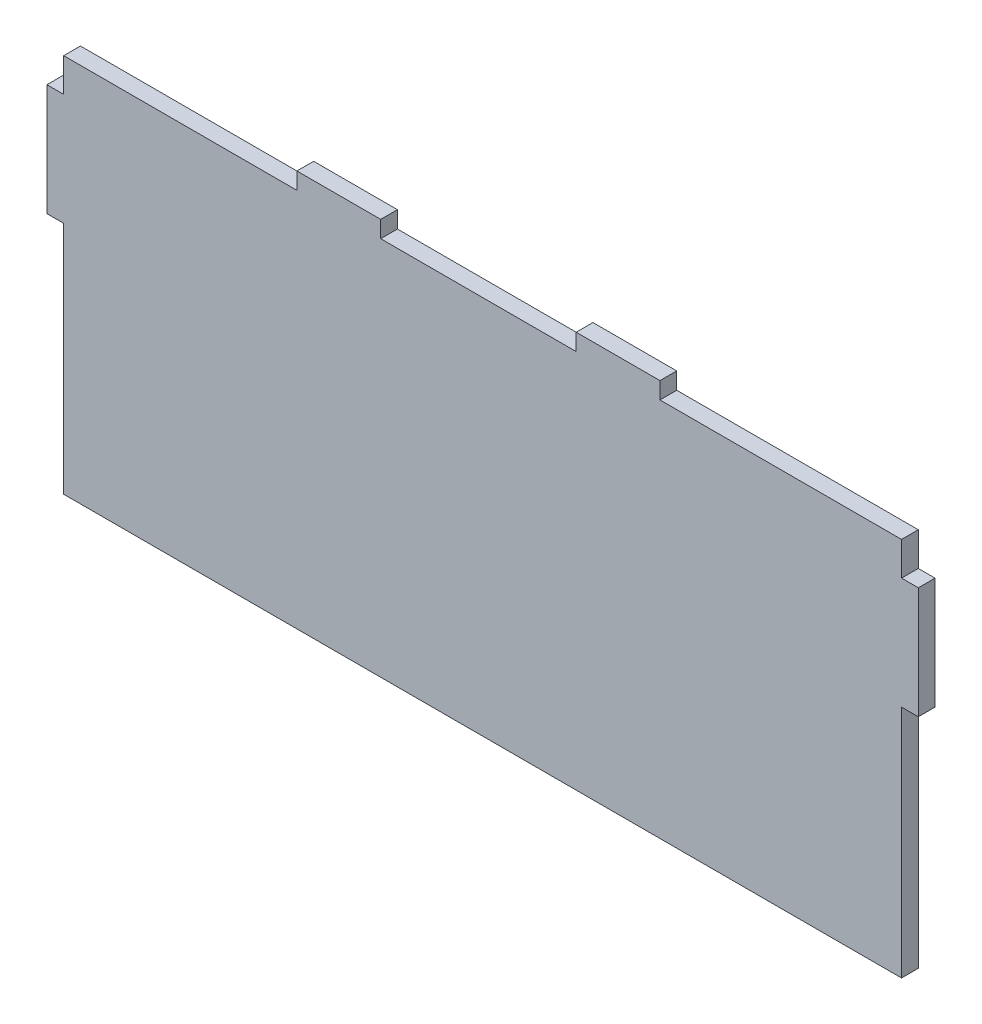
ISO-10303-21;
HEADER;
FILE_DESCRIPTION(('STEP AP214'),'2;1');
FILE_NAME('part.step','',(''),(''),'','','');
FILE_SCHEMA(('AUTOMOTIVE_DESIGN { 1 0 10303 214 1 1 1 1 }'));
ENDSEC;
DATA;
#1=APPLICATION_CONTEXT('core data for automotive mechanical design processes');
#2=APPLICATION_PROTOCOL_DEFINITION('international standard','automotive_design',2000,#1);
#3=PRODUCT_CONTEXT('',#1,'mechanical');
#4=PRODUCT('Part','Part','',(#3));
#5=PRODUCT_RELATED_PRODUCT_CATEGORY('part','',(#4));
#6=PRODUCT_DEFINITION_FORMATION('','',#4);
#7=PRODUCT_DEFINITION_CONTEXT('part definition',#1,'design');
#8=PRODUCT_DEFINITION('design','',#6,#7);
#9=PRODUCT_DEFINITION_SHAPE('','',#8);
#10=(LENGTH_UNIT() NAMED_UNIT(*) SI_UNIT(.MILLI.,.METRE.));
#11=(NAMED_UNIT(*) PLANE_ANGLE_UNIT() SI_UNIT($,.RADIAN.));
#12=(NAMED_UNIT(*) SI_UNIT($,.STERADIAN.) SOLID_ANGLE_UNIT());
#13=UNCERTAINTY_MEASURE_WITH_UNIT(LENGTH_MEASURE(1.E-05),#10,'distance_accuracy_value','');
#14=(GEOMETRIC_REPRESENTATION_CONTEXT(3) GLOBAL_UNCERTAINTY_ASSIGNED_CONTEXT((#13)) GLOBAL_UNIT_ASSIGNED_CONTEXT((#10,
#11,#12)) REPRESENTATION_CONTEXT('',''));
#15=CARTESIAN_POINT('',(0.,0.,0.));
#16=DIRECTION('',(0.,0.,1.));
#17=DIRECTION('',(1.,0.,0.));
#18=AXIS2_PLACEMENT_3D('',#15,#16,#17);
#19=CARTESIAN_POINT('',(-375.,122.5,15.));
#20=DIRECTION('',(1.,0.,0.));
#21=DIRECTION('',(0.,1.,0.));
#22=AXIS2_PLACEMENT_3D('',#19,#20,#21);
#23=PLANE('',#22);
#24=DIRECTION('',(0.,-1.,0.));
#25=VECTOR('',#24,1.);
#26=CARTESIAN_POINT('',(-375.,122.5,0.));
#27=LINE('',#26,#25);
#28=CARTESIAN_POINT('',(-375.,152.5,0.));
#29=VERTEX_POINT('',#28);
#30=CARTESIAN_POINT('',(-375.,122.5,0.));
#31=VERTEX_POINT('',#30);
#32=EDGE_CURVE('E205',#29,#31,#27,.T.);
#33=ORIENTED_EDGE('',*,*,#32,.T.);
#34=DIRECTION('',(0.,0.,-1.));
#35=VECTOR('',#34,1.);
#36=CARTESIAN_POINT('',(-375.,122.5,15.));
#37=LINE('',#36,#35);
#38=CARTESIAN_POINT('',(-375.,122.5,15.));
#39=VERTEX_POINT('',#38);
#40=EDGE_CURVE('E11',#39,#31,#37,.T.);
#41=ORIENTED_EDGE('',*,*,#40,.F.);
#42=DIRECTION('',(0.,-1.,0.));
#43=VECTOR('',#42,1.);
#44=CARTESIAN_POINT('',(-375.,122.5,15.));
#45=LINE('',#44,#43);
#46=CARTESIAN_POINT('',(-375.,152.5,15.));
#47=VERTEX_POINT('',#46);
#48=EDGE_CURVE('E243',#47,#39,#45,.T.);
#49=ORIENTED_EDGE('',*,*,#48,.F.);
#50=DIRECTION('',(0.,0.,-1.));
#51=VECTOR('',#50,1.);
#52=CARTESIAN_POINT('',(-375.,152.5,15.));
#53=LINE('',#52,#51);
#54=EDGE_CURVE('E201',#47,#29,#53,.T.);
#55=ORIENTED_EDGE('',*,*,#54,.T.);
#56=EDGE_LOOP('',(#33,#41,#49,#55));
#57=FACE_BOUND('',#56,.T.);
#58=ADVANCED_FACE('F37',(#57),#23,.F.);
#59=CARTESIAN_POINT('',(-375.,122.5,15.));
#60=DIRECTION('',(0.,-1.,0.));
#61=DIRECTION('',(0.,0.,-1.));
#62=AXIS2_PLACEMENT_3D('',#59,#60,#61);
#63=PLANE('',#62);
#64=DIRECTION('',(-1.,0.,0.));
#65=VECTOR('',#64,1.);
#66=CARTESIAN_POINT('',(-375.,122.5,0.));
#67=LINE('',#66,#65);
#68=CARTESIAN_POINT('',(-390.,122.5,0.));
#69=VERTEX_POINT('',#68);
#70=EDGE_CURVE('E208',#31,#69,#67,.T.);
#71=ORIENTED_EDGE('',*,*,#70,.T.);
#72=DIRECTION('',(0.,0.,-1.));
#73=VECTOR('',#72,1.);
#74=CARTESIAN_POINT('',(-390.,122.5,15.));
#75=LINE('',#74,#73);
#76=CARTESIAN_POINT('',(-390.,122.5,15.));
#77=VERTEX_POINT('',#76);
#78=EDGE_CURVE('E45',#77,#69,#75,.T.);
#79=ORIENTED_EDGE('',*,*,#78,.F.);
#80=DIRECTION('',(-1.,0.,0.));
#81=VECTOR('',#80,1.);
#82=CARTESIAN_POINT('',(-375.,122.5,15.));
#83=LINE('',#82,#81);
#84=EDGE_CURVE('E132',#39,#77,#83,.T.);
#85=ORIENTED_EDGE('',*,*,#84,.F.);
#86=ORIENTED_EDGE('',*,*,#40,.T.);
#87=EDGE_LOOP('',(#71,#79,#85,#86));
#88=FACE_BOUND('',#87,.T.);
#89=ADVANCED_FACE('F361',(#88),#63,.F.);
#90=CARTESIAN_POINT('',(-390.,122.5,15.));
#91=DIRECTION('',(1.,0.,0.));
#92=DIRECTION('',(0.,1.,0.));
#93=AXIS2_PLACEMENT_3D('',#90,#91,#92);
#94=PLANE('',#93);
#95=DIRECTION('',(0.,-1.,0.));
#96=VECTOR('',#95,1.);
#97=CARTESIAN_POINT('',(-390.,122.5,0.));
#98=LINE('',#97,#96);
#99=CARTESIAN_POINT('',(-390.,22.5,0.));
#100=VERTEX_POINT('',#99);
#101=EDGE_CURVE('E210',#69,#100,#98,.T.);
#102=ORIENTED_EDGE('',*,*,#101,.T.);
#103=DIRECTION('',(0.,0.,-1.));
#104=VECTOR('',#103,1.);
#105=CARTESIAN_POINT('',(-390.,22.5,15.));
#106=LINE('',#105,#104);
#107=CARTESIAN_POINT('',(-390.,22.5,15.));
#108=VERTEX_POINT('',#107);
#109=EDGE_CURVE('E286',#108,#100,#106,.T.);
#110=ORIENTED_EDGE('',*,*,#109,.F.);
#111=DIRECTION('',(0.,-1.,0.));
#112=VECTOR('',#111,1.);
#113=CARTESIAN_POINT('',(-390.,122.5,15.));
#114=LINE('',#113,#112);
#115=EDGE_CURVE('E294',#77,#108,#114,.T.);
#116=ORIENTED_EDGE('',*,*,#115,.F.);
#117=ORIENTED_EDGE('',*,*,#78,.T.);
#118=EDGE_LOOP('',(#102,#110,#116,#117));
#119=FACE_BOUND('',#118,.T.);
#120=ADVANCED_FACE('F292',(#119),#94,.F.);
#121=CARTESIAN_POINT('',(-390.,22.5,15.));
#122=DIRECTION('',(0.,1.,0.));
#123=DIRECTION('',(0.,0.,1.));
#124=AXIS2_PLACEMENT_3D('',#121,#122,#123);
#125=PLANE('',#124);
#126=DIRECTION('',(1.,0.,0.));
#127=VECTOR('',#126,1.);
#128=CARTESIAN_POINT('',(-390.,22.5,0.));
#129=LINE('',#128,#127);
#130=CARTESIAN_POINT('',(-375.,22.5,0.));
#131=VERTEX_POINT('',#130);
#132=EDGE_CURVE('E212',#100,#131,#129,.T.);
#133=ORIENTED_EDGE('',*,*,#132,.T.);
#134=DIRECTION('',(0.,0.,-1.));
#135=VECTOR('',#134,1.);
#136=CARTESIAN_POINT('',(-375.,22.5,15.));
#137=LINE('',#136,#135);
#138=CARTESIAN_POINT('',(-375.,22.5,15.));
#139=VERTEX_POINT('',#138);
#140=EDGE_CURVE('E283',#139,#131,#137,.T.);
#141=ORIENTED_EDGE('',*,*,#140,.F.);
#142=DIRECTION('',(1.,0.,0.));
#143=VECTOR('',#142,1.);
#144=CARTESIAN_POINT('',(-390.,22.5,15.));
#145=LINE('',#144,#143);
#146=EDGE_CURVE('E312',#108,#139,#145,.T.);
#147=ORIENTED_EDGE('',*,*,#146,.F.);
#148=ORIENTED_EDGE('',*,*,#109,.T.);
#149=EDGE_LOOP('',(#133,#141,#147,#148));
#150=FACE_BOUND('',#149,.T.);
#151=ADVANCED_FACE('F303',(#150),#125,.F.);
#152=CARTESIAN_POINT('',(-375.,22.5,15.));
#153=DIRECTION('',(1.,0.,0.));
#154=DIRECTION('',(0.,1.,0.));
#155=AXIS2_PLACEMENT_3D('',#152,#153,#154);
#156=PLANE('',#155);
#157=DIRECTION('',(0.,-1.,0.));
#158=VECTOR('',#157,1.);
#159=CARTESIAN_POINT('',(-375.,22.5,0.));
#160=LINE('',#159,#158);
#161=CARTESIAN_POINT('',(-375.,-187.5,0.));
#162=VERTEX_POINT('',#161);
#163=EDGE_CURVE('E214',#131,#162,#160,.T.);
#164=ORIENTED_EDGE('',*,*,#163,.T.);
#165=DIRECTION('',(0.,0.,-1.));
#166=VECTOR('',#165,1.);
#167=CARTESIAN_POINT('',(-375.,-187.5,15.));
#168=LINE('',#167,#166);
#169=CARTESIAN_POINT('',(-375.,-187.5,15.));
#170=VERTEX_POINT('',#169);
#171=EDGE_CURVE('E280',#170,#162,#168,.T.);
#172=ORIENTED_EDGE('',*,*,#171,.F.);
#173=DIRECTION('',(0.,-1.,0.));
#174=VECTOR('',#173,1.);
#175=CARTESIAN_POINT('',(-375.,22.5,15.));
#176=LINE('',#175,#174);
#177=EDGE_CURVE('E309',#139,#170,#176,.T.);
#178=ORIENTED_EDGE('',*,*,#177,.F.);
#179=ORIENTED_EDGE('',*,*,#140,.T.);
#180=EDGE_LOOP('',(#164,#172,#178,#179));
#181=FACE_BOUND('',#180,.T.);
#182=ADVANCED_FACE('F307',(#181),#156,.F.);
#183=CARTESIAN_POINT('',(-375.,-187.5,15.));
#184=DIRECTION('',(0.,1.,0.));
#185=DIRECTION('',(0.,0.,1.));
#186=AXIS2_PLACEMENT_3D('',#183,#184,#185);
#187=PLANE('',#186);
#188=DIRECTION('',(1.,0.,0.));
#189=VECTOR('',#188,1.);
#190=CARTESIAN_POINT('',(-375.,-187.5,0.));
#191=LINE('',#190,#189);
#192=CARTESIAN_POINT('',(375.,-187.5,0.));
#193=VERTEX_POINT('',#192);
#194=EDGE_CURVE('E216',#162,#193,#191,.T.);
#195=ORIENTED_EDGE('',*,*,#194,.T.);
#196=DIRECTION('',(0.,0.,-1.));
#197=VECTOR('',#196,1.);
#198=CARTESIAN_POINT('',(375.,-187.5,15.));
#199=LINE('',#198,#197);
#200=CARTESIAN_POINT('',(375.,-187.5,15.));
#201=VERTEX_POINT('',#200);
#202=EDGE_CURVE('E277',#201,#193,#199,.T.);
#203=ORIENTED_EDGE('',*,*,#202,.F.);
#204=DIRECTION('',(1.,0.,0.));
#205=VECTOR('',#204,1.);
#206=CARTESIAN_POINT('',(-375.,-187.5,15.));
#207=LINE('',#206,#205);
#208=EDGE_CURVE('E311',#170,#201,#207,.T.);
#209=ORIENTED_EDGE('',*,*,#208,.F.);
#210=ORIENTED_EDGE('',*,*,#171,.T.);
#211=EDGE_LOOP('',(#195,#203,#209,#210));
#212=FACE_BOUND('',#211,.T.);
#213=ADVANCED_FACE('F374',(#212),#187,.F.);
#214=CARTESIAN_POINT('',(375.,22.5,15.));
#215=DIRECTION('',(-1.,0.,0.));
#216=DIRECTION('',(0.,-1.,0.));
#217=AXIS2_PLACEMENT_3D('',#214,#215,#216);
#218=PLANE('',#217);
#219=DIRECTION('',(0.,1.,0.));
#220=VECTOR('',#219,1.);
#221=CARTESIAN_POINT('',(375.,22.5,0.));
#222=LINE('',#221,#220);
#223=CARTESIAN_POINT('',(375.,22.5,0.));
#224=VERTEX_POINT('',#223);
#225=EDGE_CURVE('E218',#193,#224,#222,.T.);
#226=ORIENTED_EDGE('',*,*,#225,.T.);
#227=DIRECTION('',(0.,0.,-1.));
#228=VECTOR('',#227,1.);
#229=CARTESIAN_POINT('',(375.,22.5,15.));
#230=LINE('',#229,#228);
#231=CARTESIAN_POINT('',(375.,22.5,15.));
#232=VERTEX_POINT('',#231);
#233=EDGE_CURVE('E274',#232,#224,#230,.T.);
#234=ORIENTED_EDGE('',*,*,#233,.F.);
#235=DIRECTION('',(0.,1.,0.));
#236=VECTOR('',#235,1.);
#237=CARTESIAN_POINT('',(375.,22.5,15.));
#238=LINE('',#237,#236);
#239=EDGE_CURVE('E314',#201,#232,#238,.T.);
#240=ORIENTED_EDGE('',*,*,#239,.F.);
#241=ORIENTED_EDGE('',*,*,#202,.T.);
#242=EDGE_LOOP('',(#226,#234,#240,#241));
#243=FACE_BOUND('',#242,.T.);
#244=ADVANCED_FACE('F377',(#243),#218,.F.);
#245=CARTESIAN_POINT('',(390.,22.5,15.));
#246=DIRECTION('',(0.,1.,0.));
#247=DIRECTION('',(0.,0.,1.));
#248=AXIS2_PLACEMENT_3D('',#245,#246,#247);
#249=PLANE('',#248);
#250=DIRECTION('',(1.,0.,0.));
#251=VECTOR('',#250,1.);
#252=CARTESIAN_POINT('',(390.,22.5,0.));
#253=LINE('',#252,#251);
#254=CARTESIAN_POINT('',(390.,22.5,0.));
#255=VERTEX_POINT('',#254);
#256=EDGE_CURVE('E220',#224,#255,#253,.T.);
#257=ORIENTED_EDGE('',*,*,#256,.T.);
#258=DIRECTION('',(0.,0.,-1.));
#259=VECTOR('',#258,1.);
#260=CARTESIAN_POINT('',(390.,22.5,15.));
#261=LINE('',#260,#259);
#262=CARTESIAN_POINT('',(390.,22.5,15.));
#263=VERTEX_POINT('',#262);
#264=EDGE_CURVE('E271',#263,#255,#261,.T.);
#265=ORIENTED_EDGE('',*,*,#264,.F.);
#266=DIRECTION('',(1.,0.,0.));
#267=VECTOR('',#266,1.);
#268=CARTESIAN_POINT('',(390.,22.5,15.));
#269=LINE('',#268,#267);
#270=EDGE_CURVE('E320',#232,#263,#269,.T.);
#271=ORIENTED_EDGE('',*,*,#270,.F.);
#272=ORIENTED_EDGE('',*,*,#233,.T.);
#273=EDGE_LOOP('',(#257,#265,#271,#272));
#274=FACE_BOUND('',#273,.T.);
#275=ADVANCED_FACE('F381',(#274),#249,.F.);
#276=CARTESIAN_POINT('',(390.,122.5,15.));
#277=DIRECTION('',(-1.,0.,0.));
#278=DIRECTION('',(0.,-1.,0.));
#279=AXIS2_PLACEMENT_3D('',#276,#277,#278);
#280=PLANE('',#279);
#281=DIRECTION('',(0.,1.,0.));
#282=VECTOR('',#281,1.);
#283=CARTESIAN_POINT('',(390.,122.5,0.));
#284=LINE('',#283,#282);
#285=CARTESIAN_POINT('',(390.,122.5,0.));
#286=VERTEX_POINT('',#285);
#287=EDGE_CURVE('E222',#255,#286,#284,.T.);
#288=ORIENTED_EDGE('',*,*,#287,.T.);
#289=DIRECTION('',(0.,0.,-1.));
#290=VECTOR('',#289,1.);
#291=CARTESIAN_POINT('',(390.,122.5,15.));
#292=LINE('',#291,#290);
#293=CARTESIAN_POINT('',(390.,122.5,15.));
#294=VERTEX_POINT('',#293);
#295=EDGE_CURVE('E268',#294,#286,#292,.T.);
#296=ORIENTED_EDGE('',*,*,#295,.F.);
#297=DIRECTION('',(0.,1.,0.));
#298=VECTOR('',#297,1.);
#299=CARTESIAN_POINT('',(390.,122.5,15.));
#300=LINE('',#299,#298);
#301=EDGE_CURVE('E322',#263,#294,#300,.T.);
#302=ORIENTED_EDGE('',*,*,#301,.F.);
#303=ORIENTED_EDGE('',*,*,#264,.T.);
#304=EDGE_LOOP('',(#288,#296,#302,#303));
#305=FACE_BOUND('',#304,.T.);
#306=ADVANCED_FACE('F385',(#305),#280,.F.);
#307=CARTESIAN_POINT('',(375.,122.5,15.));
#308=DIRECTION('',(0.,-1.,0.));
#309=DIRECTION('',(0.,0.,-1.));
#310=AXIS2_PLACEMENT_3D('',#307,#308,#309);
#311=PLANE('',#310);
#312=DIRECTION('',(-1.,0.,0.));
#313=VECTOR('',#312,1.);
#314=CARTESIAN_POINT('',(375.,122.5,0.));
#315=LINE('',#314,#313);
#316=CARTESIAN_POINT('',(375.,122.5,0.));
#317=VERTEX_POINT('',#316);
#318=EDGE_CURVE('E224',#286,#317,#315,.T.);
#319=ORIENTED_EDGE('',*,*,#318,.T.);
#320=DIRECTION('',(0.,0.,-1.));
#321=VECTOR('',#320,1.);
#322=CARTESIAN_POINT('',(375.,122.5,15.));
#323=LINE('',#322,#321);
#324=CARTESIAN_POINT('',(375.,122.5,15.));
#325=VERTEX_POINT('',#324);
#326=EDGE_CURVE('E265',#325,#317,#323,.T.);
#327=ORIENTED_EDGE('',*,*,#326,.F.);
#328=DIRECTION('',(-1.,0.,0.));
#329=VECTOR('',#328,1.);
#330=CARTESIAN_POINT('',(375.,122.5,15.));
#331=LINE('',#330,#329);
#332=EDGE_CURVE('E324',#294,#325,#331,.T.);
#333=ORIENTED_EDGE('',*,*,#332,.F.);
#334=ORIENTED_EDGE('',*,*,#295,.T.);
#335=EDGE_LOOP('',(#319,#327,#333,#334));
#336=FACE_BOUND('',#335,.T.);
#337=ADVANCED_FACE('F389',(#336),#311,.F.);
#338=CARTESIAN_POINT('',(375.,152.5,15.));
#339=DIRECTION('',(-1.,0.,0.));
#340=DIRECTION('',(0.,-1.,0.));
#341=AXIS2_PLACEMENT_3D('',#338,#339,#340);
#342=PLANE('',#341);
#343=DIRECTION('',(0.,1.,0.));
#344=VECTOR('',#343,1.);
#345=CARTESIAN_POINT('',(375.,152.5,0.));
#346=LINE('',#345,#344);
#347=CARTESIAN_POINT('',(375.,152.5,0.));
#348=VERTEX_POINT('',#347);
#349=EDGE_CURVE('E226',#317,#348,#346,.T.);
#350=ORIENTED_EDGE('',*,*,#349,.T.);
#351=DIRECTION('',(0.,0.,-1.));
#352=VECTOR('',#351,1.);
#353=CARTESIAN_POINT('',(375.,152.5,15.));
#354=LINE('',#353,#352);
#355=CARTESIAN_POINT('',(375.,152.5,15.));
#356=VERTEX_POINT('',#355);
#357=EDGE_CURVE('E262',#356,#348,#354,.T.);
#358=ORIENTED_EDGE('',*,*,#357,.F.);
#359=DIRECTION('',(0.,1.,0.));
#360=VECTOR('',#359,1.);
#361=CARTESIAN_POINT('',(375.,152.5,15.));
#362=LINE('',#361,#360);
#363=EDGE_CURVE('E326',#325,#356,#362,.T.);
#364=ORIENTED_EDGE('',*,*,#363,.F.);
#365=ORIENTED_EDGE('',*,*,#326,.T.);
#366=EDGE_LOOP('',(#350,#358,#364,#365));
#367=FACE_BOUND('',#366,.T.);
#368=ADVANCED_FACE('F393',(#367),#342,.F.);
#369=CARTESIAN_POINT('',(158.75,152.5,15.));
#370=DIRECTION('',(0.,-1.,0.));
#371=DIRECTION('',(0.,0.,-1.));
#372=AXIS2_PLACEMENT_3D('',#369,#370,#371);
#373=PLANE('',#372);
#374=DIRECTION('',(-1.,0.,0.));
#375=VECTOR('',#374,1.);
#376=CARTESIAN_POINT('',(158.75,152.5,0.));
#377=LINE('',#376,#375);
#378=CARTESIAN_POINT('',(158.75,152.5,0.));
#379=VERTEX_POINT('',#378);
#380=EDGE_CURVE('E228',#348,#379,#377,.T.);
#381=ORIENTED_EDGE('',*,*,#380,.T.);
#382=DIRECTION('',(0.,0.,-1.));
#383=VECTOR('',#382,1.);
#384=CARTESIAN_POINT('',(158.75,152.5,15.));
#385=LINE('',#384,#383);
#386=CARTESIAN_POINT('',(158.75,152.5,15.));
#387=VERTEX_POINT('',#386);
#388=EDGE_CURVE('E259',#387,#379,#385,.T.);
#389=ORIENTED_EDGE('',*,*,#388,.F.);
#390=DIRECTION('',(-1.,0.,0.));
#391=VECTOR('',#390,1.);
#392=CARTESIAN_POINT('',(158.75,152.5,15.));
#393=LINE('',#392,#391);
#394=EDGE_CURVE('E328',#356,#387,#393,.T.);
#395=ORIENTED_EDGE('',*,*,#394,.F.);
#396=ORIENTED_EDGE('',*,*,#357,.T.);
#397=EDGE_LOOP('',(#381,#389,#395,#396));
#398=FACE_BOUND('',#397,.T.);
#399=ADVANCED_FACE('F397',(#398),#373,.F.);
#400=CARTESIAN_POINT('',(158.75,167.5,15.));
#401=DIRECTION('',(-1.,0.,0.));
#402=DIRECTION('',(0.,0.,1.));
#403=AXIS2_PLACEMENT_3D('',#400,#401,#402);
#404=PLANE('',#403);
#405=DIRECTION('',(0.,1.,0.));
#406=VECTOR('',#405,1.);
#407=CARTESIAN_POINT('',(158.75,167.5,0.));
#408=LINE('',#407,#406);
#409=CARTESIAN_POINT('',(158.75,167.5,0.));
#410=VERTEX_POINT('',#409);
#411=EDGE_CURVE('E230',#379,#410,#408,.T.);
#412=ORIENTED_EDGE('',*,*,#411,.T.);
#413=DIRECTION('',(0.,0.,-1.));
#414=VECTOR('',#413,1.);
#415=CARTESIAN_POINT('',(158.75,167.5,15.));
#416=LINE('',#415,#414);
#417=CARTESIAN_POINT('',(158.75,167.5,15.));
#418=VERTEX_POINT('',#417);
#419=EDGE_CURVE('E256',#418,#410,#416,.T.);
#420=ORIENTED_EDGE('',*,*,#419,.F.);
#421=DIRECTION('',(0.,1.,0.));
#422=VECTOR('',#421,1.);
#423=CARTESIAN_POINT('',(158.75,167.5,15.));
#424=LINE('',#423,#422);
#425=EDGE_CURVE('E330',#387,#418,#424,.T.);
#426=ORIENTED_EDGE('',*,*,#425,.F.);
#427=ORIENTED_EDGE('',*,*,#388,.T.);
#428=EDGE_LOOP('',(#412,#420,#426,#427));
#429=FACE_BOUND('',#428,.T.);
#430=ADVANCED_FACE('F401',(#429),#404,.F.);
#431=CARTESIAN_POINT('',(83.7499999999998,167.5,15.));
#432=DIRECTION('',(0.,-1.,0.));
#433=DIRECTION('',(1.,0.,0.));
#434=AXIS2_PLACEMENT_3D('',#431,#432,#433);
#435=PLANE('',#434);
#436=DIRECTION('',(-1.,0.,0.));
#437=VECTOR('',#436,1.);
#438=CARTESIAN_POINT('',(83.7499999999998,167.5,0.));
#439=LINE('',#438,#437);
#440=CARTESIAN_POINT('',(83.7499999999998,167.5,0.));
#441=VERTEX_POINT('',#440);
#442=EDGE_CURVE('E232',#410,#441,#439,.T.);
#443=ORIENTED_EDGE('',*,*,#442,.T.);
#444=DIRECTION('',(0.,0.,-1.));
#445=VECTOR('',#444,1.);
#446=CARTESIAN_POINT('',(83.7499999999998,167.5,15.));
#447=LINE('',#446,#445);
#448=CARTESIAN_POINT('',(83.7499999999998,167.5,15.));
#449=VERTEX_POINT('',#448);
#450=EDGE_CURVE('E253',#449,#441,#447,.T.);
#451=ORIENTED_EDGE('',*,*,#450,.F.);
#452=DIRECTION('',(-1.,0.,0.));
#453=VECTOR('',#452,1.);
#454=CARTESIAN_POINT('',(83.7499999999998,167.5,15.));
#455=LINE('',#454,#453);
#456=EDGE_CURVE('E332',#418,#449,#455,.T.);
#457=ORIENTED_EDGE('',*,*,#456,.F.);
#458=ORIENTED_EDGE('',*,*,#419,.T.);
#459=EDGE_LOOP('',(#443,#451,#457,#458));
#460=FACE_BOUND('',#459,.T.);
#461=ADVANCED_FACE('F405',(#460),#435,.F.);
#462=CARTESIAN_POINT('',(83.7499999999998,152.5,15.));
#463=DIRECTION('',(1.,0.,0.));
#464=DIRECTION('',(0.,0.,-1.));
#465=AXIS2_PLACEMENT_3D('',#462,#463,#464);
#466=PLANE('',#465);
#467=DIRECTION('',(0.,-1.,0.));
#468=VECTOR('',#467,1.);
#469=CARTESIAN_POINT('',(83.7499999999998,152.5,0.));
#470=LINE('',#469,#468);
#471=CARTESIAN_POINT('',(83.7499999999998,152.5,0.));
#472=VERTEX_POINT('',#471);
#473=EDGE_CURVE('E234',#441,#472,#470,.T.);
#474=ORIENTED_EDGE('',*,*,#473,.T.);
#475=DIRECTION('',(0.,0.,-1.));
#476=VECTOR('',#475,1.);
#477=CARTESIAN_POINT('',(83.7499999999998,152.5,15.));
#478=LINE('',#477,#476);
#479=CARTESIAN_POINT('',(83.7499999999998,152.5,15.));
#480=VERTEX_POINT('',#479);
#481=EDGE_CURVE('E250',#480,#472,#478,.T.);
#482=ORIENTED_EDGE('',*,*,#481,.F.);
#483=DIRECTION('',(0.,-1.,0.));
#484=VECTOR('',#483,1.);
#485=CARTESIAN_POINT('',(83.7499999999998,152.5,15.));
#486=LINE('',#485,#484);
#487=EDGE_CURVE('E334',#449,#480,#486,.T.);
#488=ORIENTED_EDGE('',*,*,#487,.F.);
#489=ORIENTED_EDGE('',*,*,#450,.T.);
#490=EDGE_LOOP('',(#474,#482,#488,#489));
#491=FACE_BOUND('',#490,.T.);
#492=ADVANCED_FACE('F409',(#491),#466,.F.);
#493=CARTESIAN_POINT('',(-91.2500000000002,152.5,15.));
#494=DIRECTION('',(0.,-1.,0.));
#495=DIRECTION('',(0.,0.,-1.));
#496=AXIS2_PLACEMENT_3D('',#493,#494,#495);
#497=PLANE('',#496);
#498=DIRECTION('',(-1.,0.,0.));
#499=VECTOR('',#498,1.);
#500=CARTESIAN_POINT('',(-91.2500000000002,152.5,0.));
#501=LINE('',#500,#499);
#502=CARTESIAN_POINT('',(-91.2500000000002,152.5,0.));
#503=VERTEX_POINT('',#502);
#504=EDGE_CURVE('E236',#472,#503,#501,.T.);
#505=ORIENTED_EDGE('',*,*,#504,.T.);
#506=DIRECTION('',(0.,0.,-1.));
#507=VECTOR('',#506,1.);
#508=CARTESIAN_POINT('',(-91.2500000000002,152.5,15.));
#509=LINE('',#508,#507);
#510=CARTESIAN_POINT('',(-91.2500000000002,152.5,15.));
#511=VERTEX_POINT('',#510);
#512=EDGE_CURVE('E247',#511,#503,#509,.T.);
#513=ORIENTED_EDGE('',*,*,#512,.F.);
#514=DIRECTION('',(-1.,0.,0.));
#515=VECTOR('',#514,1.);
#516=CARTESIAN_POINT('',(-91.2500000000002,152.5,15.));
#517=LINE('',#516,#515);
#518=EDGE_CURVE('E336',#480,#511,#517,.T.);
#519=ORIENTED_EDGE('',*,*,#518,.F.);
#520=ORIENTED_EDGE('',*,*,#481,.T.);
#521=EDGE_LOOP('',(#505,#513,#519,#520));
#522=FACE_BOUND('',#521,.T.);
#523=ADVANCED_FACE('F342',(#522),#497,.F.);
#524=CARTESIAN_POINT('',(-91.2500000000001,167.5,15.));
#525=DIRECTION('',(-1.,0.,0.));
#526=DIRECTION('',(0.,-1.,0.));
#527=AXIS2_PLACEMENT_3D('',#524,#525,#526);
#528=PLANE('',#527);
#529=DIRECTION('',(0.,1.,0.));
#530=VECTOR('',#529,1.);
#531=CARTESIAN_POINT('',(-91.2500000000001,167.5,0.));
#532=LINE('',#531,#530);
#533=CARTESIAN_POINT('',(-91.2500000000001,167.5,0.));
#534=VERTEX_POINT('',#533);
#535=EDGE_CURVE('E238',#503,#534,#532,.T.);
#536=ORIENTED_EDGE('',*,*,#535,.T.);
#537=DIRECTION('',(0.,0.,-1.));
#538=VECTOR('',#537,1.);
#539=CARTESIAN_POINT('',(-91.2500000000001,167.5,15.));
#540=LINE('',#539,#538);
#541=CARTESIAN_POINT('',(-91.2500000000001,167.5,15.));
#542=VERTEX_POINT('',#541);
#543=EDGE_CURVE('E196',#542,#534,#540,.T.);
#544=ORIENTED_EDGE('',*,*,#543,.F.);
#545=DIRECTION('',(0.,1.,0.));
#546=VECTOR('',#545,1.);
#547=CARTESIAN_POINT('',(-91.2500000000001,167.5,15.));
#548=LINE('',#547,#546);
#549=EDGE_CURVE('E187',#511,#542,#548,.T.);
#550=ORIENTED_EDGE('',*,*,#549,.F.);
#551=ORIENTED_EDGE('',*,*,#512,.T.);
#552=EDGE_LOOP('',(#536,#544,#550,#551));
#553=FACE_BOUND('',#552,.T.);
#554=ADVANCED_FACE('F346',(#553),#528,.F.);
#555=CARTESIAN_POINT('',(-166.25,167.5,15.));
#556=DIRECTION('',(0.,-1.,0.));
#557=DIRECTION('',(1.,0.,0.));
#558=AXIS2_PLACEMENT_3D('',#555,#556,#557);
#559=PLANE('',#558);
#560=DIRECTION('',(-1.,0.,0.));
#561=VECTOR('',#560,1.);
#562=CARTESIAN_POINT('',(-166.25,167.5,0.));
#563=LINE('',#562,#561);
#564=CARTESIAN_POINT('',(-166.25,167.5,0.));
#565=VERTEX_POINT('',#564);
#566=EDGE_CURVE('E195',#534,#565,#563,.T.);
#567=ORIENTED_EDGE('',*,*,#566,.T.);
#568=DIRECTION('',(0.,0.,-1.));
#569=VECTOR('',#568,1.);
#570=CARTESIAN_POINT('',(-166.25,167.5,15.));
#571=LINE('',#570,#569);
#572=CARTESIAN_POINT('',(-166.25,167.5,15.));
#573=VERTEX_POINT('',#572);
#574=EDGE_CURVE('E192',#573,#565,#571,.T.);
#575=ORIENTED_EDGE('',*,*,#574,.F.);
#576=DIRECTION('',(-1.,0.,0.));
#577=VECTOR('',#576,1.);
#578=CARTESIAN_POINT('',(-166.25,167.5,15.));
#579=LINE('',#578,#577);
#580=EDGE_CURVE('E181',#542,#573,#579,.T.);
#581=ORIENTED_EDGE('',*,*,#580,.F.);
#582=ORIENTED_EDGE('',*,*,#543,.T.);
#583=EDGE_LOOP('',(#567,#575,#581,#582));
#584=FACE_BOUND('',#583,.T.);
#585=ADVANCED_FACE('F193',(#584),#559,.F.);
#586=CARTESIAN_POINT('',(-166.25,152.5,15.));
#587=DIRECTION('',(1.,0.,0.));
#588=DIRECTION('',(0.,0.,-1.));
#589=AXIS2_PLACEMENT_3D('',#586,#587,#588);
#590=PLANE('',#589);
#591=DIRECTION('',(0.,-1.,0.));
#592=VECTOR('',#591,1.);
#593=CARTESIAN_POINT('',(-166.25,152.5,0.));
#594=LINE('',#593,#592);
#595=CARTESIAN_POINT('',(-166.25,152.5,0.));
#596=VERTEX_POINT('',#595);
#597=EDGE_CURVE('E118',#565,#596,#594,.T.);
#598=ORIENTED_EDGE('',*,*,#597,.T.);
#599=DIRECTION('',(0.,0.,-1.));
#600=VECTOR('',#599,1.);
#601=CARTESIAN_POINT('',(-166.25,152.5,15.));
#602=LINE('',#601,#600);
#603=CARTESIAN_POINT('',(-166.25,152.5,15.));
#604=VERTEX_POINT('',#603);
#605=EDGE_CURVE('E197',#604,#596,#602,.T.);
#606=ORIENTED_EDGE('',*,*,#605,.F.);
#607=DIRECTION('',(0.,-1.,0.));
#608=VECTOR('',#607,1.);
#609=CARTESIAN_POINT('',(-166.25,152.5,15.));
#610=LINE('',#609,#608);
#611=EDGE_CURVE('E185',#573,#604,#610,.T.);
#612=ORIENTED_EDGE('',*,*,#611,.F.);
#613=ORIENTED_EDGE('',*,*,#574,.T.);
#614=EDGE_LOOP('',(#598,#606,#612,#613));
#615=FACE_BOUND('',#614,.T.);
#616=ADVANCED_FACE('F199',(#615),#590,.F.);
#617=CARTESIAN_POINT('',(-375.,152.5,15.));
#618=DIRECTION('',(0.,-1.,0.));
#619=DIRECTION('',(1.,0.,0.));
#620=AXIS2_PLACEMENT_3D('',#617,#618,#619);
#621=PLANE('',#620);
#622=DIRECTION('',(-1.,0.,0.));
#623=VECTOR('',#622,1.);
#624=CARTESIAN_POINT('',(-375.,152.5,0.));
#625=LINE('',#624,#623);
#626=EDGE_CURVE('E124',#596,#29,#625,.T.);
#627=ORIENTED_EDGE('',*,*,#626,.T.);
#628=ORIENTED_EDGE('',*,*,#54,.F.);
#629=DIRECTION('',(-1.,0.,0.));
#630=VECTOR('',#629,1.);
#631=CARTESIAN_POINT('',(-375.,152.5,15.));
#632=LINE('',#631,#630);
#633=EDGE_CURVE('E53',#604,#47,#632,.T.);
#634=ORIENTED_EDGE('',*,*,#633,.F.);
#635=ORIENTED_EDGE('',*,*,#605,.T.);
#636=EDGE_LOOP('',(#627,#628,#634,#635));
#637=FACE_BOUND('',#636,.T.);
#638=ADVANCED_FACE('F350',(#637),#621,.F.);
#639=CARTESIAN_POINT('',(0.,0.,15.));
#640=DIRECTION('',(0.,0.,-1.));
#641=DIRECTION('',(-1.,0.,0.));
#642=AXIS2_PLACEMENT_3D('',#639,#640,#641);
#643=PLANE('',#642);
#644=ORIENTED_EDGE('',*,*,#48,.T.);
#645=ORIENTED_EDGE('',*,*,#84,.T.);
#646=ORIENTED_EDGE('',*,*,#115,.T.);
#647=ORIENTED_EDGE('',*,*,#146,.T.);
#648=ORIENTED_EDGE('',*,*,#177,.T.);
#649=ORIENTED_EDGE('',*,*,#208,.T.);
#650=ORIENTED_EDGE('',*,*,#239,.T.);
#651=ORIENTED_EDGE('',*,*,#270,.T.);
#652=ORIENTED_EDGE('',*,*,#301,.T.);
#653=ORIENTED_EDGE('',*,*,#332,.T.);
#654=ORIENTED_EDGE('',*,*,#363,.T.);
#655=ORIENTED_EDGE('',*,*,#394,.T.);
#656=ORIENTED_EDGE('',*,*,#425,.T.);
#657=ORIENTED_EDGE('',*,*,#456,.T.);
#658=ORIENTED_EDGE('',*,*,#487,.T.);
#659=ORIENTED_EDGE('',*,*,#518,.T.);
#660=ORIENTED_EDGE('',*,*,#549,.T.);
#661=ORIENTED_EDGE('',*,*,#580,.T.);
#662=ORIENTED_EDGE('',*,*,#611,.T.);
#663=ORIENTED_EDGE('',*,*,#633,.T.);
#664=EDGE_LOOP('',(#644,#645,#646,#647,#648,#649,#650,#651,#652,#653,#654,#655,#656,#657,#658,
#659,#660,#661,#662,#663));
#665=FACE_BOUND('',#664,.T.);
#666=ADVANCED_FACE('F183',(#665),#643,.F.);
#667=CARTESIAN_POINT('',(0.,0.,0.));
#668=DIRECTION('',(0.,0.,-1.));
#669=DIRECTION('',(-1.,0.,0.));
#670=AXIS2_PLACEMENT_3D('',#667,#668,#669);
#671=PLANE('',#670);
#672=ORIENTED_EDGE('',*,*,#32,.F.);
#673=ORIENTED_EDGE('',*,*,#626,.F.);
#674=ORIENTED_EDGE('',*,*,#597,.F.);
#675=ORIENTED_EDGE('',*,*,#566,.F.);
#676=ORIENTED_EDGE('',*,*,#535,.F.);
#677=ORIENTED_EDGE('',*,*,#504,.F.);
#678=ORIENTED_EDGE('',*,*,#473,.F.);
#679=ORIENTED_EDGE('',*,*,#442,.F.);
#680=ORIENTED_EDGE('',*,*,#411,.F.);
#681=ORIENTED_EDGE('',*,*,#380,.F.);
#682=ORIENTED_EDGE('',*,*,#349,.F.);
#683=ORIENTED_EDGE('',*,*,#318,.F.);
#684=ORIENTED_EDGE('',*,*,#287,.F.);
#685=ORIENTED_EDGE('',*,*,#256,.F.);
#686=ORIENTED_EDGE('',*,*,#225,.F.);
#687=ORIENTED_EDGE('',*,*,#194,.F.);
#688=ORIENTED_EDGE('',*,*,#163,.F.);
#689=ORIENTED_EDGE('',*,*,#132,.F.);
#690=ORIENTED_EDGE('',*,*,#101,.F.);
#691=ORIENTED_EDGE('',*,*,#70,.F.);
#692=EDGE_LOOP('',(#672,#673,#674,#675,#676,#677,#678,#679,#680,#681,#682,#683,#684,#685,#686,
#687,#688,#689,#690,#691));
#693=FACE_BOUND('',#692,.T.);
#694=ADVANCED_FACE('F298',(#693),#671,.T.);
#695=CLOSED_SHELL('',(#58,#89,#120,#151,#182,#213,#244,#275,#306,#337,#368,#399,#430,#461,#492,
#523,#554,#585,#616,#638,#666,#694));
#696=MANIFOLD_SOLID_BREP('B2',#695);
#697=ADVANCED_BREP_SHAPE_REPRESENTATION('',(#18,#696),#14);
#698=SHAPE_DEFINITION_REPRESENTATION(#9,#697);
ENDSEC;
END-ISO-10303-21;
